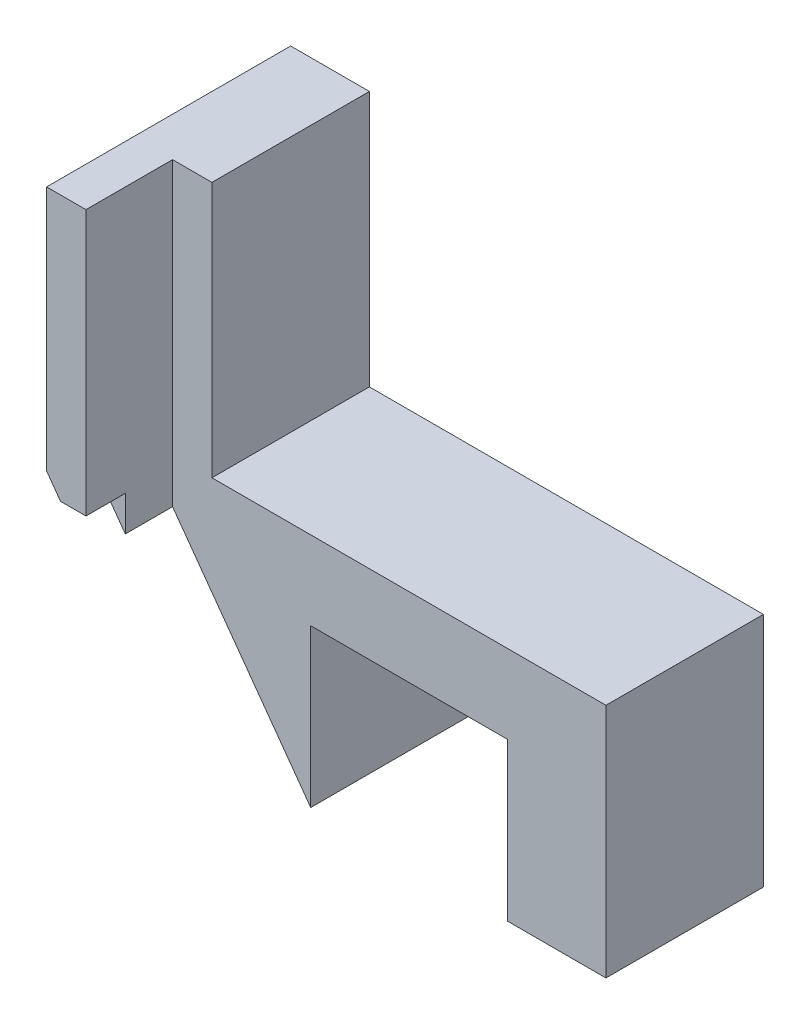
from build123d import *

# Parameters (mm, degrees)
EXTRUDE1_DEPTH      = 4
EXTRUDE2_DEPTH      = 4
SKETCH3_W           = 1
SKETCH3_H           = 12.5
EXTRUDE3_DEPTH      = 2.2
SKETCH4_W           = 1
SKETCH4_H           = 5.75854146
CUT_EXTRUDE1_DEPTH  = 1
EXTRUDE4_DEPTH      = 13.920526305
EXTRUDE4_DEPTH_BACK = 13.920526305


with BuildPart() as part:
    # Sketch1 → Extrude1 (new body)
    with BuildSketch(Plane.XY):
        Polygon((0, 0), (5, 0), (5, -4), (7.5, -4), (7.5, 2), (-2.5, 2), (-2.5, -4), (0, -4), align=None)
    extrude(amount=EXTRUDE1_DEPTH)

    # Sketch2 → Extrude2 (add)
    with BuildSketch(Plane(origin=(0, 0, 0), x_dir=(-1, 0, 0), z_dir=(0, 0, -1))):
        Polygon((2.5, 2), (2.51, 2), (2.51, 8.5), (4.51, 8.5), (4.51, -4), (2.5, -4), align=None)
    extrude(amount=-EXTRUDE2_DEPTH)

    # Sketch3 → Extrude3 (add)
    with BuildSketch(Plane.XY.offset(4)):
        with Locations((-4.01, 2.25)):
            Rectangle(SKETCH3_W, SKETCH3_H)
    extrude(amount=EXTRUDE3_DEPTH)

    # Sketch4 → Cut-Extrude1 (cut)
    with BuildSketch(Plane.XY.offset(6.2)):
        with Locations((-4.01, -1.12072927)):
            Rectangle(SKETCH4_W, SKETCH4_H)
    extrude(amount=-CUT_EXTRUDE1_DEPTH, mode=Mode.SUBTRACT)

    # Sketch5 → Extrude4 (cut, two sides: drawn at the far end of the back side and taken through both)
    with BuildSketch(Plane(origin=(0, 0, 0), x_dir=(-1, 0, 0), z_dir=(0, 0, -1)).offset(-EXTRUDE4_DEPTH_BACK)):
        Polygon((-22.911755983, -35.751324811), (0, -4), (4.51, 2.25), (27.421755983, 34.001324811), (90.924405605, -11.822187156), (40.590893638, -81.574836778), align=None)
    extrude(amount=EXTRUDE4_DEPTH + EXTRUDE4_DEPTH_BACK, mode=Mode.SUBTRACT)


solid = part.part
